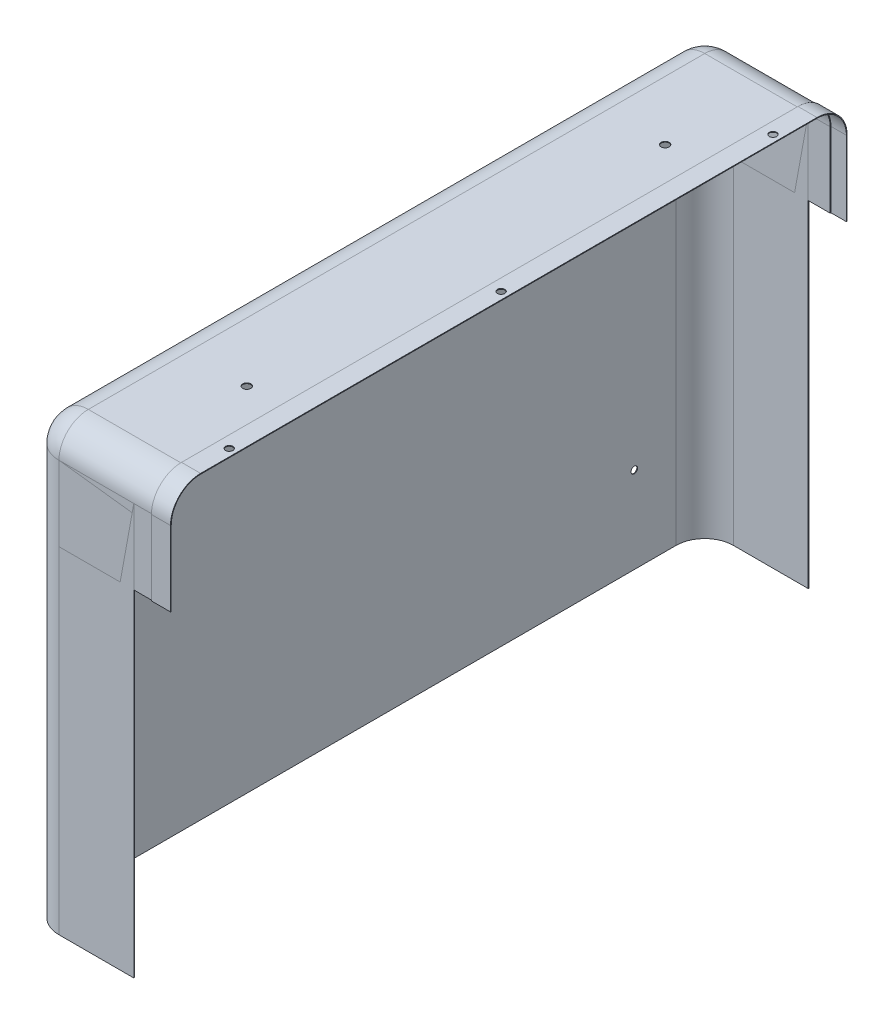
from build123d import *

# Parameters (mm, degrees)
EXTRU_MINCE9_DEPTH      = 21
EXTRU_MINCE9_DEPTH_BACK = 5
ESQUISSE12_W            = 11.872329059
ESQUISSE12_H            = 132.291666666
EXTRUSION6_DEPTH        = 1
ESQUISSE14_R            = 4.5
ESQUISSE14_R_2          = 4.899605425
ENL_V_MAT_EXTRU_3_DEPTH = 10
ESQUISSE15_R            = 5
ENL_V_MAT_EXTRU_5_DEPTH = 10
ESQUISSE17_R            = 5.5
ENL_V_MAT_EXTRU_6_DEPTH = 10


with BuildPart() as part:
    # Balayage1: sweep along a path in Esquisse1
    with BuildLine(Plane.XY) as balayage1_path:
        Line((-172, -600), (-172, -40))
        ThreePointArc((-172, -40), (-160.284271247, -11.715728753), (-132, 0))
        Line((-132, 0), (0, 0))
    # Esquisse3 → Balayage1 (sweep)
    with BuildSketch(Plane(origin=(0, 0, 0), x_dir=(0, 0, -1), z_dir=(1, 0, 0))):
        with BuildLine():
            Line((0, 0), (-529, 0))
            ThreePointArc((-529, 0), (-557.284271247, -11.715728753), (-569, -40))
            Line((-569, -40), (-569, -142))
            Line((-569, -142), (-568, -142))
            Line((-568, -142), (-568, -40))
            ThreePointArc((-568, -40), (-556.577164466, -12.422835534), (-529, -1))
            Line((-529, -1), (0, -1))
            Line((0, -1), (311, -1))
            ThreePointArc((311, -1), (338.577164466, -12.422835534), (350, -40))
            Line((350, -40), (350, -142))
            Line((350, -142), (351, -142))
            Line((351, -142), (351, -40))
            ThreePointArc((351, -40), (339.284271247, -11.715728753), (311, 0))
            Line((311, 0), (0, 0))
        make_face()
    sweep(path=balayage1_path.line)

    # Esquisse7 → Extru.-Mince9 (add, two sides: drawn at the far end of the back side and taken through both)
    with BuildSketch(Plane(origin=(0, 0, 0), x_dir=(0, 0, -1), z_dir=(1, 0, 0)).offset(-EXTRU_MINCE9_DEPTH_BACK)):
        with BuildLine():
            Line((351, -142), (351, -40))
            ThreePointArc((351, -40), (339.284271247, -11.715728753), (311, 0))
            Line((311, 0), (-529, 0))
            ThreePointArc((-529, 0), (-557.284271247, -11.715728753), (-569, -40))
            Line((-569, -40), (-569, -142))
            Line((-569, -142), (-570, -142))
            Line((-570, -142), (-570, -40))
            ThreePointArc((-570, -40), (-557.991378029, -11.008621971), (-529, 1))
            Line((-529, 1), (311, 1))
            ThreePointArc((311, 1), (339.991378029, -11.008621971), (352, -40))
            Line((352, -40), (352, -142))
            Line((352, -142), (351, -142))
        make_face()
    extrude(amount=EXTRU_MINCE9_DEPTH + EXTRU_MINCE9_DEPTH_BACK)

    # Esquisse12 → Extrusion6 (add)
    with BuildSketch(Plane.ZY.offset(172)):
        with Locations((271.400526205, -368.759128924)):
            Rectangle(ESQUISSE12_W, ESQUISSE12_H)
        Polygon((156.917353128, -302.613295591), (168.789682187, -302.613295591), (168.789682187, -352.991191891), (223.9377107, -302.613295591), (240.871680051, -302.613295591), (175.865378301, -361.97494089), (245.959821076, -434.904962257), (230.138882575, -434.904962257), (168.789682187, -371.064692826), (168.789682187, -434.904962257), (156.917353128, -434.904962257), align=None)
        Polygon((58.546626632, -302.613295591), (133.172695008, -302.613295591), (133.172695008, -316.181671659), (70.418955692, -316.181671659), (70.418955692, -356.886799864), (133.172695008, -356.886799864), (133.172695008, -370.455175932), (70.418955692, -370.455175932), (70.418955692, -421.336586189), (133.172695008, -421.336586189), (133.172695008, -434.904962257), (58.546626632, -434.904962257), align=None)
        with BuildLine():
            Line((-46.608287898, -409.384754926), (-35.424977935, -402.680069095))
            add(Edge.make_bspline(
                [(-35.424977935, -402.680069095), (-34.384854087, -404.421193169), (-32.392016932, -407.757119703), (-29.067664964, -412.264789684), (-25.623057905, -416.096037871), (-22.032687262, -419.228576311), (-18.31846839, -421.694828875), (-14.456154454, -423.441163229), (-10.458761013, -424.530338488), (-7.738321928, -424.662633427), (-6.380172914, -424.728680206)],
                knots=[0, 0, 0, 0, 1.272034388, 2.437168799, 3.508375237, 4.49857839, 5.41946034, 6.295179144, 7.148887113, 8, 8, 8, 8], degree=3))
            add(Edge.make_bspline(
                [(-6.380172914, -424.728680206), (-5.220282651, -424.69637562), (-2.920797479, -424.632331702), (0.464442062, -424.016956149), (3.752147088, -423.071557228), (6.874556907, -421.717611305), (9.788587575, -420.079519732), (12.34395969, -418.100958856), (14.553083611, -415.885783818), (16.360154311, -413.414475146), (17.746572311, -410.75665435), (18.812165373, -408.028575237), (19.403511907, -405.187382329), (19.492591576, -403.274427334), (19.537545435, -402.309058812)],
                knots=[0, 0, 0, 0, 1.095163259, 2.171163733, 3.241058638, 4.321873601, 5.38011039, 6.391990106, 7.366004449, 8.327778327, 9.272591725, 10.192022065, 11.087607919, 12, 12, 12, 12], degree=3))
            add(Edge.make_bspline(
                [(19.537545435, -402.309058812), (19.481820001, -401.207604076), (19.368538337, -398.968507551), (18.411068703, -395.665008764), (16.904862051, -392.395795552), (15.515321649, -390.373575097), (14.793913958, -389.323698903)],
                knots=[0, 0, 0, 0, 0.938893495, 1.908633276, 2.914225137, 4, 4, 4, 4], degree=3))
            add(Edge.make_bspline(
                [(14.793913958, -389.323698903), (14.201602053, -388.565976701), (12.958117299, -386.975233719), (10.820377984, -384.607392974), (8.311896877, -382.164970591), (5.518518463, -379.554702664), (2.338488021, -376.897991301), (-1.128593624, -374.068148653), (-4.971245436, -371.172791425), (-7.666196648, -369.231030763), (-9.056747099, -368.229114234)],
                knots=[0, 0, 0, 0, 0.722233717, 1.516239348, 2.393582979, 3.351407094, 4.387010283, 5.505090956, 6.712668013, 8, 8, 8, 8], degree=3))
            add(Edge.make_bspline(
                [(-9.056747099, -368.229114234), (-10.448606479, -367.237736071), (-13.109735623, -365.342296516), (-16.831235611, -362.529235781), (-20.159106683, -359.957339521), (-23.078557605, -357.602396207), (-25.588304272, -355.464086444), (-27.708123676, -353.562944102), (-29.384015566, -351.847553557), (-30.315937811, -350.734740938), (-30.734347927, -350.235115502)],
                knots=[0, 0, 0, 0, 1.452282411, 2.77665338, 3.964542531, 5.026858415, 5.96415736, 6.766646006, 7.446254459, 8, 8, 8, 8], degree=3))
            add(Edge.make_bspline(
                [(-30.734347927, -350.235115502), (-31.319173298, -349.456445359), (-32.469310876, -347.925086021), (-33.987490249, -345.53155717), (-35.277869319, -343.081392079), (-36.289421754, -340.568006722), (-37.141237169, -338.026686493), (-37.714170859, -335.424273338), (-38.072923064, -332.772444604), (-38.109661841, -330.987886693), (-38.128052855, -330.094557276)],
                knots=[0, 0, 0, 0, 1.068054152, 2.10047183, 3.106115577, 4.101338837, 5.06977816, 6.043150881, 7.020423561, 8, 8, 8, 8], degree=3))
            add(Edge.make_bspline(
                [(-38.128052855, -330.094557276), (-38.078719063, -328.694919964), (-37.981105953, -325.925561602), (-37.155586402, -321.880051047), (-35.8525931, -318.017647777), (-34.027161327, -314.37659052), (-31.673981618, -311.051685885), (-28.950815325, -308.004688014), (-25.707345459, -305.44319696), (-22.148600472, -303.205122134), (-18.25331498, -301.453356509), (-14.171515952, -300.131914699), (-9.896715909, -299.383171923), (-7.001299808, -299.275722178), (-5.53214941, -299.221201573)],
                knots=[0, 0, 0, 0, 1.005424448, 1.989358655, 2.955360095, 3.929531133, 4.905563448, 5.876582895, 6.856512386, 7.866279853, 8.892233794, 9.918561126, 10.94386622, 12, 12, 12, 12], degree=3))
            add(Edge.make_bspline(
                [(-5.53214941, -299.221201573), (-3.973220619, -299.274970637), (-0.873008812, -299.381900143), (3.687244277, -300.311628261), (8.077842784, -301.850016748), (11.60977571, -303.595838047), (14.374019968, -305.339495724), (16.482096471, -306.927745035), (18.618321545, -308.756208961), (20.799926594, -310.829757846), (22.989945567, -313.167417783), (25.22089153, -315.753178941), (27.497981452, -318.571239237), (28.962860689, -320.58299864), (29.713827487, -321.614322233)],
                knots=[0, 0, 0, 0, 1.286793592, 2.559021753, 3.825965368, 5.121522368, 5.803751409, 6.523245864, 7.299691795, 8.125521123, 9.008227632, 9.944561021, 10.946284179, 12, 12, 12, 12], degree=3))
            Line((29.713827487, -321.614322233), (18.981030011, -329.750047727))
            add(Edge.make_bspline(
                [(18.981030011, -329.750047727), (18.332954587, -328.915147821), (17.084912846, -327.30732581), (15.190137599, -325.055671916), (13.404251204, -322.998858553), (11.644756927, -321.21234925), (10.004580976, -319.598310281), (8.412657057, -318.21643852), (6.891894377, -317.053194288), (4.974915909, -315.811785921), (2.566537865, -314.581227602), (-0.456687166, -313.539938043), (-3.616049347, -312.91419612), (-5.767853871, -312.831461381), (-6.857186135, -312.789577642)],
                knots=[0, 0, 0, 0, 1.181633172, 2.275549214, 3.290209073, 4.226197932, 5.078386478, 5.862611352, 6.581680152, 7.217281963, 8.414376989, 9.595101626, 10.782541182, 12, 12, 12, 12], degree=3))
            add(Edge.make_bspline(
                [(-6.857186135, -312.789577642), (-8.223816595, -312.835377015), (-10.859234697, -312.923696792), (-14.600829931, -313.888291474), (-17.96836817, -315.407070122), (-20.861872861, -317.535642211), (-23.270978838, -320.057536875), (-25.013655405, -322.95959479), (-26.062545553, -326.164167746), (-26.190538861, -328.399581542), (-26.255723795, -329.538041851)],
                knots=[0, 0, 0, 0, 1.14458467, 2.207223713, 3.21896685, 4.227309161, 5.202851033, 6.127160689, 7.046193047, 8, 8, 8, 8], degree=3))
            add(Edge.make_bspline(
                [(-26.255723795, -329.538041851), (-26.240864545, -330.246803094), (-26.211121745, -331.665484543), (-25.796300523, -333.761416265), (-25.263379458, -335.852053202), (-24.418881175, -337.927996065), (-23.253002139, -340.025550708), (-21.722002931, -342.180836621), (-19.793821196, -344.41285061), (-18.316803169, -345.864557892), (-17.536982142, -346.631015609)],
                knots=[0, 0, 0, 0, 0.858281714, 1.717966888, 2.583508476, 3.4729293, 4.427298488, 5.488583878, 6.674047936, 8, 8, 8, 8], degree=3))
            add(Edge.make_bspline(
                [(-17.536982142, -346.631015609), (-17.247400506, -346.889438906), (-16.559420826, -347.503393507), (-15.301670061, -348.5085184), (-13.640736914, -349.748385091), (-11.619993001, -351.282489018), (-9.20217903, -353.062056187), (-6.38702914, -355.064332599), (-3.205923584, -357.354318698), (-0.948577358, -358.955332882), (0.245010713, -359.80188066)],
                knots=[0, 0, 0, 0, 0.420754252, 0.999615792, 1.744751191, 2.668019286, 3.750313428, 4.999500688, 6.413464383, 8, 8, 8, 8], degree=3))
            add(Edge.make_bspline(
                [(0.245010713, -359.80188066), (1.680787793, -360.846658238), (4.460971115, -362.869725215), (8.416778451, -365.909246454), (12.003538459, -368.88194485), (15.23384407, -371.768836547), (18.139608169, -374.548023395), (20.688593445, -377.252941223), (22.906772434, -379.864211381), (25.294796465, -383.212043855), (27.734928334, -387.323709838), (29.830485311, -392.361309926), (31.151827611, -397.418492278), (31.324620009, -400.817512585), (31.409874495, -402.494563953)],
                knots=[0, 0, 0, 0, 1.163667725, 2.253281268, 3.268753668, 4.215851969, 5.092017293, 5.902905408, 6.650798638, 7.335211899, 8.59617414, 9.77448103, 10.901945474, 12, 12, 12, 12], degree=3))
            add(Edge.make_bspline(
                [(31.409874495, -402.494563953), (31.385036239, -403.680591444), (31.335842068, -406.029614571), (30.770355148, -409.478839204), (29.941843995, -412.828875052), (28.693115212, -416.038312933), (27.168995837, -419.165867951), (25.235033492, -422.129499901), (22.993344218, -424.994801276), (20.421829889, -427.685367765), (17.607952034, -430.155298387), (14.633895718, -432.352438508), (11.49479314, -434.184425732), (8.207673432, -435.679353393), (4.771781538, -436.848566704), (1.188273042, -437.695719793), (-2.548759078, -438.215652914), (-5.088777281, -438.269618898), (-6.380172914, -438.297056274)],
                knots=[0, 0, 0, 0, 0.983748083, 1.948392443, 2.894712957, 3.844097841, 4.80183111, 5.778335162, 6.776009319, 7.81870978, 8.863265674, 9.881300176, 10.883814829, 11.87499822, 12.874611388, 13.892143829, 14.928324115, 16, 16, 16, 16], degree=3))
            add(Edge.make_bspline(
                [(-6.380172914, -438.297056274), (-7.379365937, -438.277734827), (-9.365168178, -438.239335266), (-12.30240157, -437.89986425), (-15.180296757, -437.41956599), (-17.962741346, -436.657034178), (-20.685583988, -435.731862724), (-23.336982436, -434.59270551), (-25.918221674, -433.227561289), (-28.443767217, -431.666707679), (-30.907195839, -429.850239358), (-33.285401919, -427.734574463), (-35.656415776, -425.378062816), (-37.950254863, -422.716711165), (-40.213317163, -419.793515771), (-42.400983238, -416.581126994), (-44.558536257, -413.097042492), (-45.912275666, -410.645296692), (-46.608287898, -409.384754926)],
                knots=[0, 0, 0, 0, 0.915332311, 1.819136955, 2.706846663, 3.586547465, 4.459518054, 5.340707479, 6.227863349, 7.133153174, 8.059268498, 9.028702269, 10.047606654, 11.120612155, 12.245963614, 13.433783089, 14.680604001, 16, 16, 16, 16], degree=3))
        make_face()
        with Locations((-72.89701653, -368.759128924)):
            Rectangle(ESQUISSE12_W, ESQUISSE12_H)
    extrude(amount=EXTRUSION6_DEPTH)

    # Esquisse14 → Enl_v. mat.-Extru.3 (cut)
    with BuildSketch(Plane.ZY.offset(172)):
        with Locations((-253.975767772, -482.500000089)):
            Circle(ESQUISSE14_R)
        with Locations((470.024232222, -482.499999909)):
            Circle(ESQUISSE14_R_2)
    extrude(amount=-ENL_V_MAT_EXTRU_3_DEPTH, mode=Mode.SUBTRACT)

    # Esquisse15 → Enl_v. mat.-Extru.5 (cut)
    with BuildSketch(Plane(origin=(0, 0, 0), x_dir=(-1, 0, 0), z_dir=(0, 1, 0))):
        with Locations(Location((-11, -261, 0), (0, 0, 270))):
            Circle(ESQUISSE15_R)
        with Locations(Location((-11, 109.5, 0), (0, 0, 270))):
            Circle(ESQUISSE15_R)
        with Locations(Location((-11, 480, 0), (0, 0, 270))):
            Circle(ESQUISSE15_R)
    extrude(amount=ENL_V_MAT_EXTRU_5_DEPTH, mode=Mode.SUBTRACT)

    # Esquisse17 → Enl_v. mat.-Extru.6 (cut)
    with BuildSketch(Plane(origin=(0, 0, 0), x_dir=(-1, 0, 0), z_dir=(0, 1, 0))):
        with Locations(Location((51.5, 393.524232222, 0), (0, 0, 90))):
            Circle(ESQUISSE17_R)
        with Locations(Location((51.5, -176.475767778, 0), (0, 0, 90))):
            Circle(ESQUISSE17_R)
    extrude(amount=-ENL_V_MAT_EXTRU_6_DEPTH, mode=Mode.SUBTRACT)


solid = part.part
